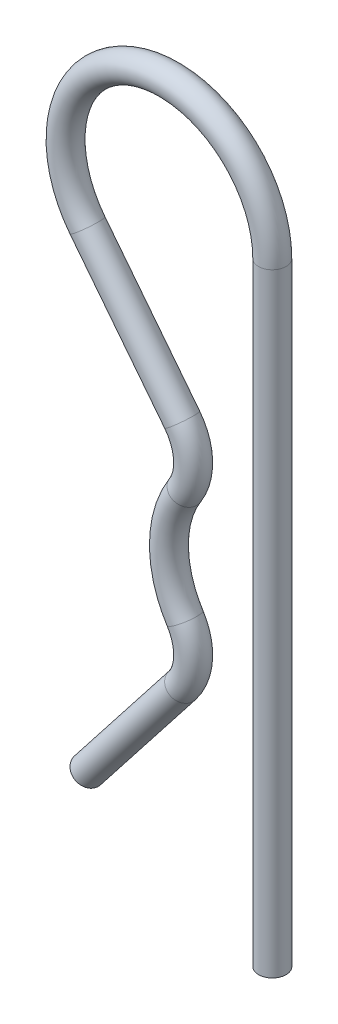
from build123d import *

# Parameters (mm, degrees)
ESQUISSE2_R = 1


with BuildPart() as part:
    # Base-Balayage: sweep along a path in Esquisse4
    with BuildLine(Plane.XY) as base_balayage_path:
        Line((0, -22.757185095), (0, 21.742814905))
        ThreePointArc((0, 21.742814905), (-9.945652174, 28.832863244), (-13.405009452, 17.118870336))
        Line((-13.405009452, 17.118870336), (-6.539245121, 8.350944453))
        ThreePointArc((-6.539245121, 8.350944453), (-5.746222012, 6.222060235), (-6.327833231, 4.025981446))
        ThreePointArc((-6.327833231, 4.025981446), (-7.5, 0), (-6.327833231, -4.025981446))
        ThreePointArc((-6.327833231, -4.025981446), (-5.746222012, -6.222060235), (-6.539245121, -8.350944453))
        Line((-6.539245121, -8.350944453), (-13.405009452, -17.118870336))
    # Esquisse2 → Base-Balayage (sweep)
    with BuildSketch(Plane(origin=(0, -22.757185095, 0), x_dir=(1, 0, 0), z_dir=(0, 1, 0))):
        Circle(ESQUISSE2_R)
    sweep(path=base_balayage_path.line)


solid = part.part
